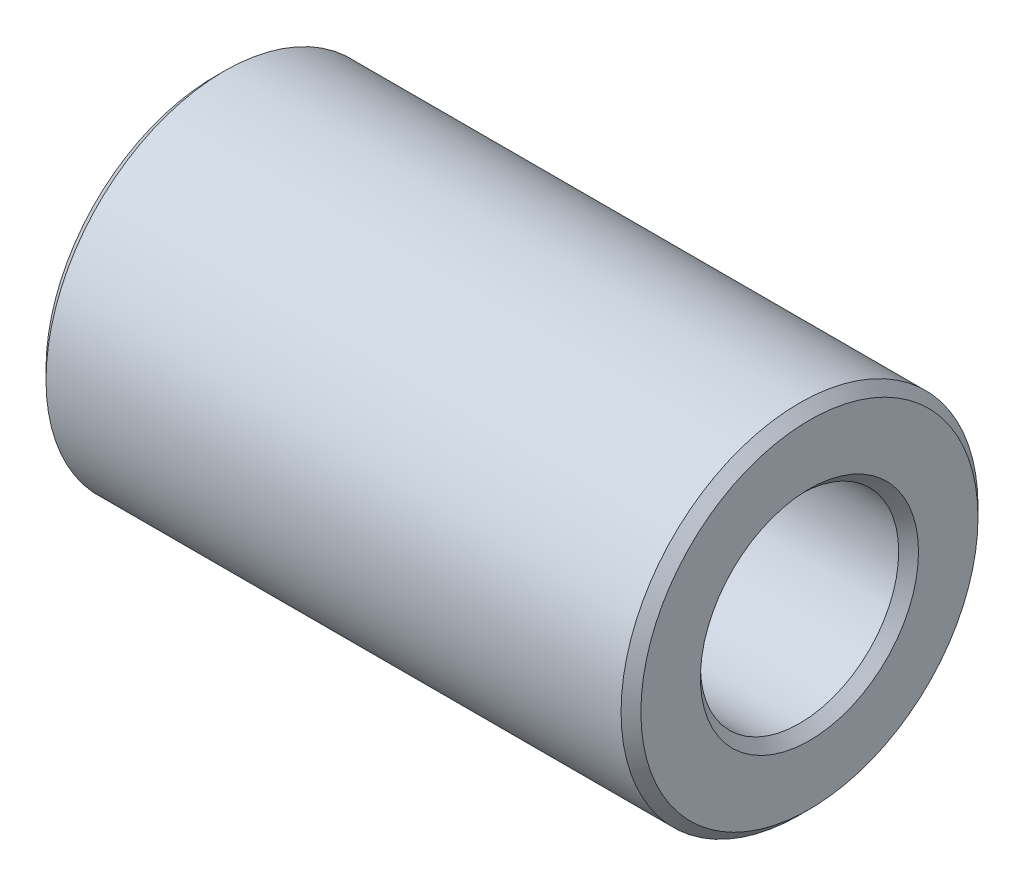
ISO-10303-21;
HEADER;
FILE_DESCRIPTION(('STEP AP214'),'2;1');
FILE_NAME('part.step','',(''),(''),'','','');
FILE_SCHEMA(('AUTOMOTIVE_DESIGN { 1 0 10303 214 1 1 1 1 }'));
ENDSEC;
DATA;
#1=APPLICATION_CONTEXT('core data for automotive mechanical design processes');
#2=APPLICATION_PROTOCOL_DEFINITION('international standard','automotive_design',2000,#1);
#3=PRODUCT_CONTEXT('',#1,'mechanical');
#4=PRODUCT('Part','Part','',(#3));
#5=PRODUCT_RELATED_PRODUCT_CATEGORY('part','',(#4));
#6=PRODUCT_DEFINITION_FORMATION('','',#4);
#7=PRODUCT_DEFINITION_CONTEXT('part definition',#1,'design');
#8=PRODUCT_DEFINITION('design','',#6,#7);
#9=PRODUCT_DEFINITION_SHAPE('','',#8);
#10=(LENGTH_UNIT() NAMED_UNIT(*) SI_UNIT(.MILLI.,.METRE.));
#11=(NAMED_UNIT(*) PLANE_ANGLE_UNIT() SI_UNIT($,.RADIAN.));
#12=(NAMED_UNIT(*) SI_UNIT($,.STERADIAN.) SOLID_ANGLE_UNIT());
#13=UNCERTAINTY_MEASURE_WITH_UNIT(LENGTH_MEASURE(1.E-05),#10,'distance_accuracy_value','');
#14=(GEOMETRIC_REPRESENTATION_CONTEXT(3) GLOBAL_UNCERTAINTY_ASSIGNED_CONTEXT((#13)) GLOBAL_UNIT_ASSIGNED_CONTEXT((#10,
#11,#12)) REPRESENTATION_CONTEXT('',''));
#15=CARTESIAN_POINT('',(0.,0.,0.));
#16=DIRECTION('',(0.,0.,1.));
#17=DIRECTION('',(1.,0.,0.));
#18=AXIS2_PLACEMENT_3D('',#15,#16,#17);
#19=CARTESIAN_POINT('',(0.,0.,0.));
#20=DIRECTION('',(-1.,0.,0.));
#21=DIRECTION('',(0.,0.,1.));
#22=AXIS2_PLACEMENT_3D('',#19,#20,#21);
#23=CYLINDRICAL_SURFACE('',#22,5.);
#24=CARTESIAN_POINT('',(14.5,0.,0.));
#25=DIRECTION('',(1.,0.,0.));
#26=DIRECTION('',(0.,0.,-1.));
#27=AXIS2_PLACEMENT_3D('',#24,#25,#26);
#28=CIRCLE('',#27,5.);
#29=CARTESIAN_POINT('',(14.5,0.,-5.));
#30=VERTEX_POINT('',#29);
#31=EDGE_CURVE('E42',#30,#30,#28,.T.);
#32=ORIENTED_EDGE('',*,*,#31,.T.);
#33=EDGE_LOOP('',(#32));
#34=FACE_BOUND('',#33,.T.);
#35=CARTESIAN_POINT('',(-14.5,0.,0.));
#36=DIRECTION('',(-1.,0.,0.));
#37=DIRECTION('',(0.,0.,1.));
#38=AXIS2_PLACEMENT_3D('',#35,#36,#37);
#39=CIRCLE('',#38,5.);
#40=CARTESIAN_POINT('',(-14.5,0.,5.));
#41=VERTEX_POINT('',#40);
#42=EDGE_CURVE('E46',#41,#41,#39,.T.);
#43=ORIENTED_EDGE('',*,*,#42,.T.);
#44=EDGE_LOOP('',(#43));
#45=FACE_BOUND('',#44,.T.);
#46=ADVANCED_FACE('F32',(#34,#45),#23,.F.);
#47=CARTESIAN_POINT('',(-15.,5.,0.));
#48=DIRECTION('',(-1.,0.,0.));
#49=DIRECTION('',(0.,0.,1.));
#50=AXIS2_PLACEMENT_3D('',#47,#48,#49);
#51=PLANE('',#50);
#52=CARTESIAN_POINT('',(-15.,0.,0.));
#53=DIRECTION('',(-1.,0.,0.));
#54=DIRECTION('',(0.,0.,1.));
#55=AXIS2_PLACEMENT_3D('',#52,#53,#54);
#56=CIRCLE('',#55,5.50000000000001);
#57=CARTESIAN_POINT('',(-15.,0.,5.50000000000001));
#58=VERTEX_POINT('',#57);
#59=EDGE_CURVE('E10',#58,#58,#56,.F.);
#60=ORIENTED_EDGE('',*,*,#59,.T.);
#61=EDGE_LOOP('',(#60));
#62=FACE_BOUND('',#61,.T.);
#63=CARTESIAN_POINT('',(-15.,0.,0.));
#64=DIRECTION('',(-1.,0.,0.));
#65=DIRECTION('',(0.,0.,1.));
#66=AXIS2_PLACEMENT_3D('',#63,#64,#65);
#67=CIRCLE('',#66,8.49999999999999);
#68=CARTESIAN_POINT('',(-15.,0.,8.49999999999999));
#69=VERTEX_POINT('',#68);
#70=EDGE_CURVE('E38',#69,#69,#67,.T.);
#71=ORIENTED_EDGE('',*,*,#70,.T.);
#72=EDGE_LOOP('',(#71));
#73=FACE_BOUND('',#72,.T.);
#74=ADVANCED_FACE('F78',(#62,#73),#51,.T.);
#75=CARTESIAN_POINT('',(0.,0.,0.));
#76=DIRECTION('',(-1.,0.,0.));
#77=DIRECTION('',(0.,0.,1.));
#78=AXIS2_PLACEMENT_3D('',#75,#76,#77);
#79=CYLINDRICAL_SURFACE('',#78,9.);
#80=CARTESIAN_POINT('',(14.5,0.,0.));
#81=DIRECTION('',(1.,0.,0.));
#82=DIRECTION('',(0.,0.,-1.));
#83=AXIS2_PLACEMENT_3D('',#80,#81,#82);
#84=CIRCLE('',#83,9.);
#85=CARTESIAN_POINT('',(14.5,0.,-9.));
#86=VERTEX_POINT('',#85);
#87=EDGE_CURVE('E57',#86,#86,#84,.F.);
#88=ORIENTED_EDGE('',*,*,#87,.T.);
#89=EDGE_LOOP('',(#88));
#90=FACE_BOUND('',#89,.T.);
#91=CARTESIAN_POINT('',(-14.5,0.,0.));
#92=DIRECTION('',(-1.,0.,0.));
#93=DIRECTION('',(0.,0.,1.));
#94=AXIS2_PLACEMENT_3D('',#91,#92,#93);
#95=CIRCLE('',#94,9.);
#96=CARTESIAN_POINT('',(-14.5,0.,9.));
#97=VERTEX_POINT('',#96);
#98=EDGE_CURVE('E60',#97,#97,#95,.F.);
#99=ORIENTED_EDGE('',*,*,#98,.T.);
#100=EDGE_LOOP('',(#99));
#101=FACE_BOUND('',#100,.T.);
#102=ADVANCED_FACE('F64',(#90,#101),#79,.T.);
#103=CARTESIAN_POINT('',(15.,9.,0.));
#104=DIRECTION('',(1.,0.,0.));
#105=DIRECTION('',(0.,0.,-1.));
#106=AXIS2_PLACEMENT_3D('',#103,#104,#105);
#107=PLANE('',#106);
#108=CARTESIAN_POINT('',(15.,0.,0.));
#109=DIRECTION('',(1.,0.,0.));
#110=DIRECTION('',(0.,0.,-1.));
#111=AXIS2_PLACEMENT_3D('',#108,#109,#110);
#112=CIRCLE('',#111,8.49999999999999);
#113=CARTESIAN_POINT('',(15.,0.,-8.49999999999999));
#114=VERTEX_POINT('',#113);
#115=EDGE_CURVE('E51',#114,#114,#112,.T.);
#116=ORIENTED_EDGE('',*,*,#115,.T.);
#117=EDGE_LOOP('',(#116));
#118=FACE_BOUND('',#117,.T.);
#119=CARTESIAN_POINT('',(15.,0.,0.));
#120=DIRECTION('',(1.,0.,0.));
#121=DIRECTION('',(0.,0.,-1.));
#122=AXIS2_PLACEMENT_3D('',#119,#120,#121);
#123=CIRCLE('',#122,5.50000000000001);
#124=CARTESIAN_POINT('',(15.,0.,-5.50000000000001));
#125=VERTEX_POINT('',#124);
#126=EDGE_CURVE('E54',#125,#125,#123,.F.);
#127=ORIENTED_EDGE('',*,*,#126,.T.);
#128=EDGE_LOOP('',(#127));
#129=FACE_BOUND('',#128,.T.);
#130=ADVANCED_FACE('F94',(#118,#129),#107,.T.);
#131=CARTESIAN_POINT('',(14.5,0.,0.));
#132=DIRECTION('',(-1.,0.,0.));
#133=DIRECTION('',(0.,0.,1.));
#134=AXIS2_PLACEMENT_3D('',#131,#132,#133);
#135=CONICAL_SURFACE('',#134,9.,0.785398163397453);
#136=ORIENTED_EDGE('',*,*,#115,.F.);
#137=EDGE_LOOP('',(#136));
#138=FACE_BOUND('',#137,.T.);
#139=ORIENTED_EDGE('',*,*,#87,.F.);
#140=EDGE_LOOP('',(#139));
#141=FACE_BOUND('',#140,.T.);
#142=ADVANCED_FACE('F90',(#138,#141),#135,.T.);
#143=CARTESIAN_POINT('',(15.,0.,0.));
#144=DIRECTION('',(1.,0.,0.));
#145=DIRECTION('',(0.,0.,-1.));
#146=AXIS2_PLACEMENT_3D('',#143,#144,#145);
#147=CONICAL_SURFACE('',#146,5.50000000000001,0.785398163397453);
#148=ORIENTED_EDGE('',*,*,#31,.F.);
#149=EDGE_LOOP('',(#148));
#150=FACE_BOUND('',#149,.T.);
#151=ORIENTED_EDGE('',*,*,#126,.F.);
#152=EDGE_LOOP('',(#151));
#153=FACE_BOUND('',#152,.T.);
#154=ADVANCED_FACE('F74',(#150,#153),#147,.F.);
#155=CARTESIAN_POINT('',(-14.5,0.,0.));
#156=DIRECTION('',(-1.,0.,0.));
#157=DIRECTION('',(0.,0.,1.));
#158=AXIS2_PLACEMENT_3D('',#155,#156,#157);
#159=CONICAL_SURFACE('',#158,5.,0.785398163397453);
#160=ORIENTED_EDGE('',*,*,#59,.F.);
#161=EDGE_LOOP('',(#160));
#162=FACE_BOUND('',#161,.T.);
#163=ORIENTED_EDGE('',*,*,#42,.F.);
#164=EDGE_LOOP('',(#163));
#165=FACE_BOUND('',#164,.T.);
#166=ADVANCED_FACE('F69',(#162,#165),#159,.F.);
#167=CARTESIAN_POINT('',(-15.,0.,0.));
#168=DIRECTION('',(1.,0.,0.));
#169=DIRECTION('',(0.,0.,-1.));
#170=AXIS2_PLACEMENT_3D('',#167,#168,#169);
#171=CONICAL_SURFACE('',#170,8.49999999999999,0.785398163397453);
#172=ORIENTED_EDGE('',*,*,#98,.F.);
#173=EDGE_LOOP('',(#172));
#174=FACE_BOUND('',#173,.T.);
#175=ORIENTED_EDGE('',*,*,#70,.F.);
#176=EDGE_LOOP('',(#175));
#177=FACE_BOUND('',#176,.T.);
#178=ADVANCED_FACE('F66',(#174,#177),#171,.T.);
#179=CLOSED_SHELL('',(#46,#74,#102,#130,#142,#154,#166,#178));
#180=MANIFOLD_SOLID_BREP('B2',#179);
#181=ADVANCED_BREP_SHAPE_REPRESENTATION('',(#18,#180),#14);
#182=SHAPE_DEFINITION_REPRESENTATION(#9,#181);
ENDSEC;
END-ISO-10303-21;
